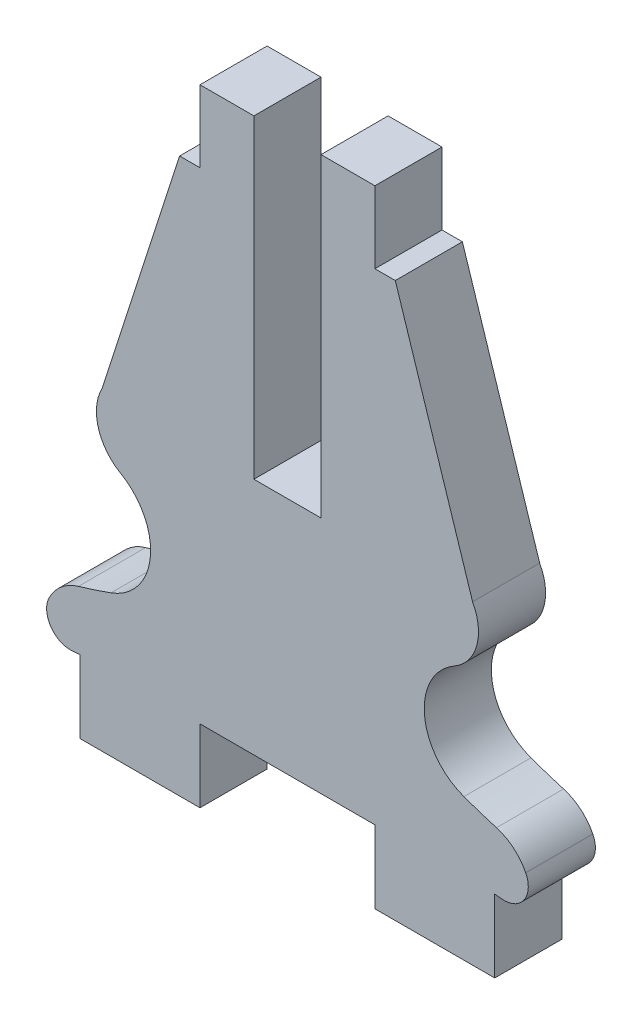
from build123d import *

# Parameters (mm, degrees)
BOSS_EXTRUDE1_DEPTH = 2.8


with BuildPart() as part:
    # Sketch1 → Boss-Extrude1 (new body)
    with BuildSketch(Plane.XY):
        with BuildLine():
            Line((-8.65, 0.035634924), (-8.948449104, 0.005169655))
            ThreePointArc((-8.948449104, 0.005169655), (-9.873657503, 0.432912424), (-9.943106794, 1.449844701))
            ThreePointArc((-9.943106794, 1.449844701), (-9.438399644, 2.085649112), (-8.72257182, 2.468489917))
            ThreePointArc((-8.72257182, 2.468489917), (-8.039265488, 2.680898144), (-7.362466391, 2.913207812))
            ThreePointArc((-7.362466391, 2.913207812), (-5.718148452, 5.047506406), (-6.966359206, 7.435179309))
            ThreePointArc((-6.966359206, 7.435179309), (-7.897543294, 8.628181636), (-7.726500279, 10.131877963))
            Line((-7.726500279, 10.131877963), (-4.5, 20.131877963))
            Line((-4.5, 20.131877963), (-3.65, 20.131877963))
            Line((-3.65, 20.131877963), (-3.65, 23.131877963))
            Line((-3.65, 23.131877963), (-1.4, 23.131877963))
            Line((-1.4, 23.131877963), (-1.4, 10))
            Line((-1.4, 10), (1.4, 10))
            Line((1.4, 10), (1.4, 23.131877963))
            Line((1.4, 23.131877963), (3.65, 23.131877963))
            Line((3.65, 23.131877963), (3.65, 20.131877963))
            Line((3.65, 20.131877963), (4.5, 20.131877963))
            Line((4.5, 20.131877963), (7.726500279, 10.131877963))
            ThreePointArc((7.726500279, 10.131877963), (7.897543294, 8.628181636), (6.966359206, 7.435179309))
            ThreePointArc((6.966359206, 7.435179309), (5.718148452, 5.047506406), (7.362466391, 2.913207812))
            ThreePointArc((7.362466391, 2.913207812), (8.039265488, 2.680898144), (8.72257182, 2.468489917))
            ThreePointArc((8.72257182, 2.468489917), (9.438399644, 2.085649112), (9.943106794, 1.449844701))
            ThreePointArc((9.943106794, 1.449844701), (9.873657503, 0.432912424), (8.948449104, 0.005169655))
            Line((8.948449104, 0.005169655), (8.65, 0.035634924))
            Line((8.65, 0.035634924), (8.65, -3))
            Line((8.65, -3), (3.65, -3))
            Line((3.65, -3), (3.65, 0.035634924))
            Line((3.65, 0.035634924), (-3.65, 0.035634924))
            Line((-3.65, 0.035634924), (-3.65, -3))
            Line((-3.65, -3), (-8.65, -3))
            Line((-8.65, -3), (-8.65, 0.035634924))
        make_face()
    extrude(amount=BOSS_EXTRUDE1_DEPTH)


solid = part.part
